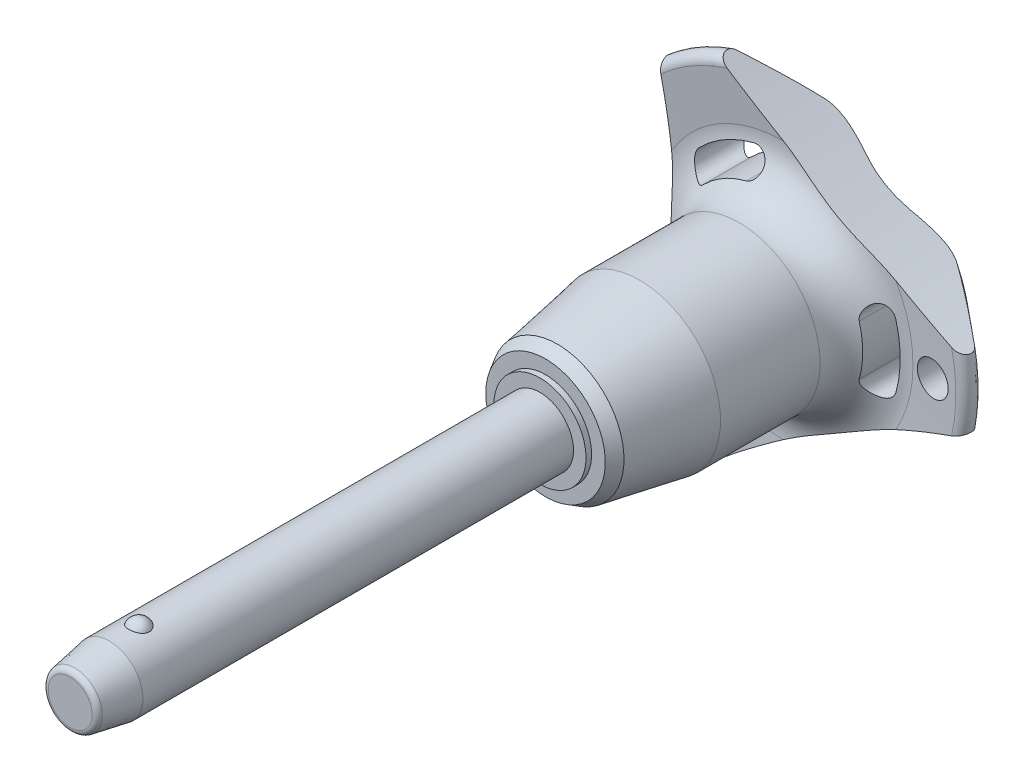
from build123d import *

# Parameters (mm, degrees)
SKETCH1_R           = 3
BOSS_EXTRUDE1_DEPTH = 35
SKETCH2_R           = 2.5
BOSS_EXTRUDE2_DEPTH = 26.7
BOSS_EXTRUDE3_START = 7
SKETCH1_2_R         = 3
BOSS_EXTRUDE3_DEPTH = 7
CHAMFER1_SIZE       = 3.5
CHAMFER1_SIZE2      = 0.617144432
FILLET1_R           = 0.5
SKETCH6_R           = 79.96
CUT_EXTRUDE1_DEPTH  = 67.015920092
CIRPATTERN1_COUNT   = 3
SKETCH7_R           = 1.5
CUT_EXTRUDE2_DEPTH  = 66.784951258


with BuildPart() as part:
    # Sketch1 → Boss-Extrude1 (new body)
    with BuildSketch(Plane.XY):
        Circle(SKETCH1_R)
    extrude(amount=-BOSS_EXTRUDE1_DEPTH)

    # Sketch2 → Boss-Extrude2 (add)
    with BuildSketch(Plane(origin=(0, 0, -35), x_dir=(-1, 0, 0), z_dir=(0, 0, -1))):
        Circle(SKETCH2_R)
    extrude(amount=BOSS_EXTRUDE2_DEPTH)

    # Sketch3 → Revolve1 (revolve)
    with BuildSketch(Plane(origin=(0, 0, 0), x_dir=(0, 0, -1), z_dir=(1, 0, 0))):
        with BuildLine():
            Line((-0.866025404, 3.5), (-0.866025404, 1.5))
            ThreePointArc((-0.866025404, 1.5), (0.133974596, 2.5), (-0.866025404, 3.5))
        make_face()
        with BuildLine():
            Line((-0.866025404, -1.5), (-0.866025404, -3.5))
            ThreePointArc((-0.866025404, -3.5), (0.133974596, -2.5), (-0.866025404, -1.5))
        make_face()
    revolve(axis=Axis((0, -1.5, 0.866025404), (0, 1, 0)))

    # Sketch1_2 → Boss-Extrude3 (add)
    with BuildSketch(Plane.XY.offset(BOSS_EXTRUDE3_START)):
        Circle(SKETCH1_2_R)
    extrude(amount=-BOSS_EXTRUDE3_DEPTH)

    # Chamfer1
    chamfer1_edges = [part.edges().sort_by_distance(p)[0] for p in [
        (-3, 0, 7),
    ]]
    chamfer1_side = [part.faces().sort_by_distance(p)[0] for p in [
        (-3, 0, -14),
    ]]
    chamfer(chamfer1_edges, length=CHAMFER1_SIZE, length2=CHAMFER1_SIZE2, reference=chamfer1_side[0])

    # Fillet1
    fillet1_edges = [part.edges().sort_by_distance(p)[0] for p in [
        (-2.382855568, 0, 7),
        (2.5, 0, -61.7),
    ]]
    fillet(fillet1_edges, radius=FILLET1_R)

    # Sketch4 → Revolve2 (revolve)
    with BuildSketch(Plane(origin=(0, 0, 0), x_dir=(0, 0, -1), z_dir=(1, 0, 0)), mode=Mode.PRIVATE) as revolve2_sk:
        Polygon((35, 0), (35, 4.118359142), (35.5, 4.118359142), (35.5, 5.343400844), (36.560917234, 5.955921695), (43.9, 7.25), (52.8, 7.25), (52.8, 0), align=None)
    revolve(revolve2_sk.sketch.rotate(Axis((0, 0, -52.8), (0, 0, 1)), 90), axis=Axis((0, 0, -52.8), (0, 0, 1)))

    # Sketch5 → Revolve3 (revolve)
    with BuildSketch(Plane(origin=(0, 0, 0), x_dir=(0, 0, -1), z_dir=(1, 0, 0)), mode=Mode.PRIVATE) as revolve3_sk:
        with BuildLine():
            Line((56.78715932, 11.570250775), (56.452568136, 15.735949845))
            ThreePointArc((56.452568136, 15.735949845), (56.946485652, 16.540188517), (57.862835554, 16.314230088))
            Line((57.862835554, 16.314230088), (61.326414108, 12.186497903))
            ThreePointArc((61.326414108, 12.186497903), (61.7, 11.109282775), (61.261488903, 10.056825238))
            ThreePointArc((61.261488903, 10.056825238), (58.289873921, 5.413681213), (57.25, 0))
            Line((57.25, 0), (52.8, 0))
            Line((52.8, 0), (52.8, 7.25))
            ThreePointArc((52.8, 7.25), (55.739473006, 8.537160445), (56.78715932, 11.570250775))
        make_face()
    revolve(revolve3_sk.sketch.rotate(Axis((0, 0, -57.25), (0, 0, 1)), 90), axis=Axis((0, 0, -57.25), (0, 0, 1)))

    # Sketch6 → Cut-Extrude1 (cut, through all)
    with BuildSketch(Plane.XY):
        with Locations((-89.76, 0)):
            Circle(SKETCH6_R)
        with BuildLine():
            ThreePointArc((10.099921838, -2.834717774), (10.490188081, 0), (10.099921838, 2.834717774))
            ThreePointArc((10.099921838, 2.834717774), (8.768180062, 3.582738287), (8.020159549, 2.250996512))
            ThreePointArc((8.020159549, 2.250996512), (8.330062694, 0), (8.020159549, -2.250996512))
            ThreePointArc((8.020159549, -2.250996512), (8.768180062, -3.582738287), (10.099921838, -2.834717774))
        make_face()
    cut_extrude1 = extrude(amount=-CUT_EXTRUDE1_DEPTH, mode=Mode.SUBTRACT)

    # CirPattern1: Cut-Extrude1 ×3 about axis
    cirpattern1_axis = Axis((0, 0, 0), (0, 0, 1))
    for i in range(1, CIRPATTERN1_COUNT):
        add(cut_extrude1.rotate(cirpattern1_axis, i * 360 / CIRPATTERN1_COUNT), mode=Mode.SUBTRACT)

    # Sketch7 → Cut-Extrude2 (cut, through all)
    with BuildSketch(Plane.XY):
        with Locations(Location((13.490188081, 0, 0), (0, 0, 225.221865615))):
            Circle(SKETCH7_R)
    extrude(amount=-CUT_EXTRUDE2_DEPTH, mode=Mode.SUBTRACT)


solid = part.part
